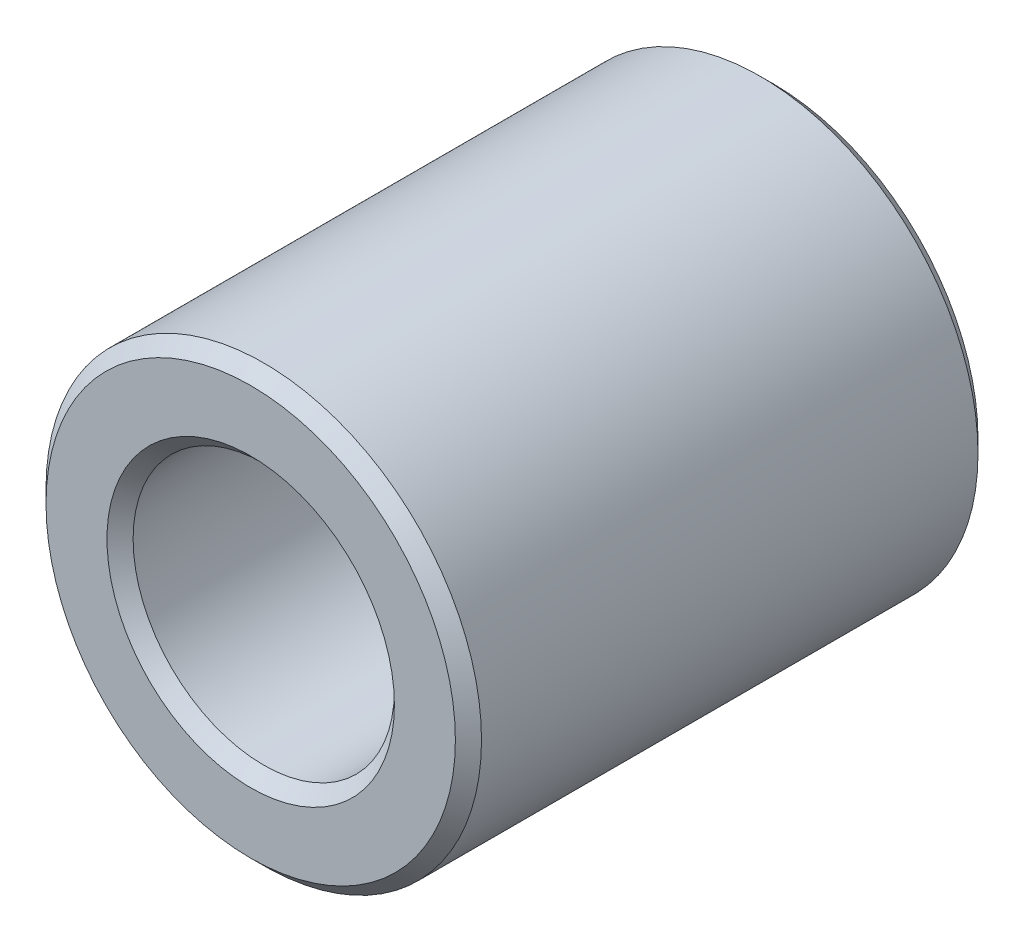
from build123d import *

# Parameters (mm, degrees)
SKETCH1_R           = 50
SKETCH1_R_2         = 30
BOSS_EXTRUDE1_DEPTH = 60
CHAMFER1_SIZE       = 3


with BuildPart() as part:
    # Sketch1 → Boss-Extrude1 (new, symmetric)
    with BuildSketch(Plane.XY):
        Circle(SKETCH1_R)
        Circle(SKETCH1_R_2, mode=Mode.SUBTRACT)
    extrude(amount=BOSS_EXTRUDE1_DEPTH, both=True)

    # Chamfer1
    chamfer1_edges = [part.edges().sort_by_distance(p)[0] for p in [
        (-50, 0, -60),
        (-50, 0, 60),
        (-30, 0, -60),
        (-30, 0, 60),
    ]]
    chamfer(chamfer1_edges, length=CHAMFER1_SIZE)


solid = part.part
